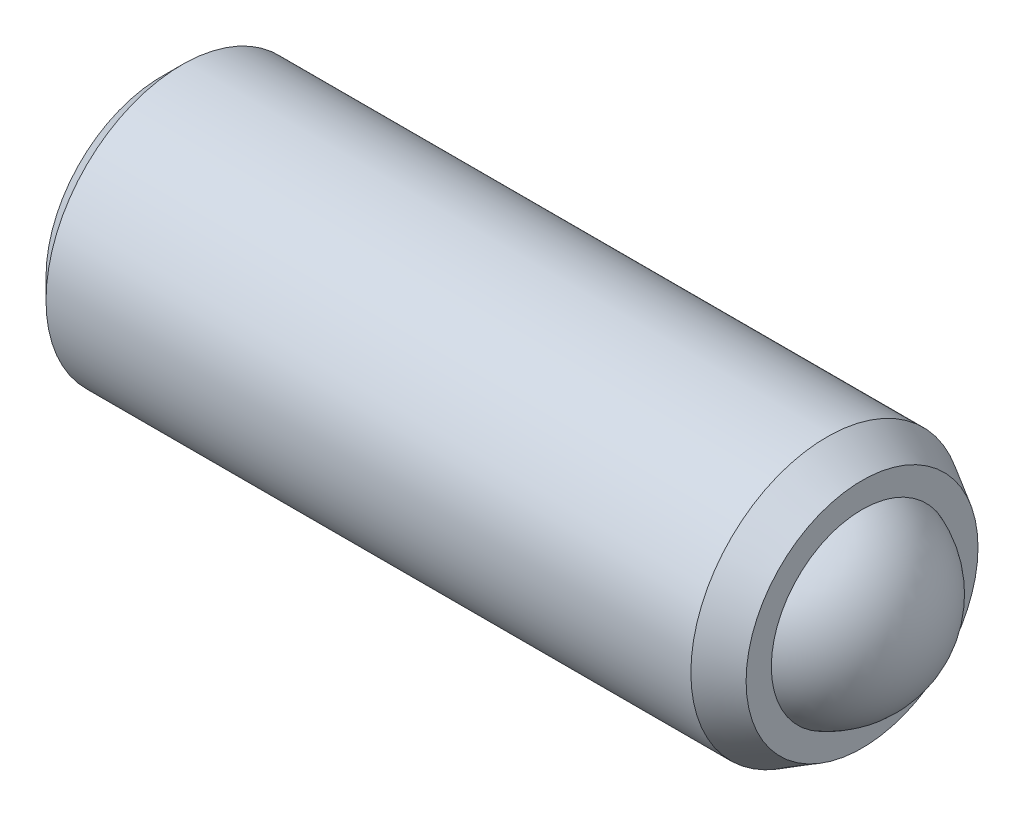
ISO-10303-21;
HEADER;
FILE_DESCRIPTION(('STEP AP214'),'2;1');
FILE_NAME('part.step','',(''),(''),'','','');
FILE_SCHEMA(('AUTOMOTIVE_DESIGN { 1 0 10303 214 1 1 1 1 }'));
ENDSEC;
DATA;
#1=APPLICATION_CONTEXT('core data for automotive mechanical design processes');
#2=APPLICATION_PROTOCOL_DEFINITION('international standard','automotive_design',2000,#1);
#3=PRODUCT_CONTEXT('',#1,'mechanical');
#4=PRODUCT('Part','Part','',(#3));
#5=PRODUCT_RELATED_PRODUCT_CATEGORY('part','',(#4));
#6=PRODUCT_DEFINITION_FORMATION('','',#4);
#7=PRODUCT_DEFINITION_CONTEXT('part definition',#1,'design');
#8=PRODUCT_DEFINITION('design','',#6,#7);
#9=PRODUCT_DEFINITION_SHAPE('','',#8);
#10=(LENGTH_UNIT() NAMED_UNIT(*) SI_UNIT(.MILLI.,.METRE.));
#11=(NAMED_UNIT(*) PLANE_ANGLE_UNIT() SI_UNIT($,.RADIAN.));
#12=(NAMED_UNIT(*) SI_UNIT($,.STERADIAN.) SOLID_ANGLE_UNIT());
#13=UNCERTAINTY_MEASURE_WITH_UNIT(LENGTH_MEASURE(1.E-05),#10,'distance_accuracy_value','');
#14=(GEOMETRIC_REPRESENTATION_CONTEXT(3) GLOBAL_UNCERTAINTY_ASSIGNED_CONTEXT((#13)) GLOBAL_UNIT_ASSIGNED_CONTEXT((#10,
#11,#12)) REPRESENTATION_CONTEXT('',''));
#15=CARTESIAN_POINT('',(0.,0.,0.));
#16=DIRECTION('',(0.,0.,1.));
#17=DIRECTION('',(1.,0.,0.));
#18=AXIS2_PLACEMENT_3D('',#15,#16,#17);
#19=CARTESIAN_POINT('',(8.55,0.,0.));
#20=DIRECTION('',(0.,-1.,0.));
#21=DIRECTION('',(-1.,0.,0.));
#22=AXIS2_PLACEMENT_3D('',#19,#20,#21);
#23=SPHERICAL_SURFACE('',#22,1.25);
#24=CARTESIAN_POINT('',(8.55,-1.25,0.));
#25=VERTEX_POINT('',#24);
#26=VERTEX_LOOP('',#25);
#27=FACE_BOUND('',#26,.T.);
#28=ADVANCED_FACE('P0_F11',(#27),#23,.T.);
#29=CLOSED_SHELL('',(#28));
#30=MANIFOLD_SOLID_BREP('P0_B1',#29);
#31=CARTESIAN_POINT('',(0.,0.,0.));
#32=DIRECTION('',(1.,0.,0.));
#33=DIRECTION('',(0.,0.,-1.));
#34=AXIS2_PLACEMENT_3D('',#31,#32,#33);
#35=PLANE('',#34);
#36=CARTESIAN_POINT('',(0.,0.,0.));
#37=DIRECTION('',(-1.,0.,0.));
#38=DIRECTION('',(0.,0.,1.));
#39=AXIS2_PLACEMENT_3D('',#36,#37,#38);
#40=CIRCLE('',#39,1.4875);
#41=CARTESIAN_POINT('',(0.,0.,1.4875));
#42=VERTEX_POINT('',#41);
#43=EDGE_CURVE('P1_E10',#42,#42,#40,.T.);
#44=ORIENTED_EDGE('',*,*,#43,.T.);
#45=EDGE_LOOP('',(#44));
#46=FACE_BOUND('',#45,.T.);
#47=ADVANCED_FACE('P1_F15',(#46),#35,.F.);
#48=CARTESIAN_POINT('',(0.2625,0.,0.));
#49=DIRECTION('',(1.,0.,0.));
#50=DIRECTION('',(0.,0.,-1.));
#51=AXIS2_PLACEMENT_3D('',#48,#49,#50);
#52=CONICAL_SURFACE('',#51,1.75,0.78539816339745);
#53=ORIENTED_EDGE('',*,*,#43,.F.);
#54=EDGE_LOOP('',(#53));
#55=FACE_BOUND('',#54,.T.);
#56=CARTESIAN_POINT('',(0.2625,0.,0.));
#57=DIRECTION('',(-1.,0.,0.));
#58=DIRECTION('',(0.,0.,1.));
#59=AXIS2_PLACEMENT_3D('',#56,#57,#58);
#60=CIRCLE('',#59,1.75);
#61=CARTESIAN_POINT('',(0.2625,0.,1.75));
#62=VERTEX_POINT('',#61);
#63=EDGE_CURVE('P1_E21',#62,#62,#60,.T.);
#64=ORIENTED_EDGE('',*,*,#63,.T.);
#65=EDGE_LOOP('',(#64));
#66=FACE_BOUND('',#65,.T.);
#67=ADVANCED_FACE('P1_F39',(#55,#66),#52,.T.);
#68=CARTESIAN_POINT('',(0.,0.,0.));
#69=DIRECTION('',(-1.,0.,0.));
#70=DIRECTION('',(0.,0.,1.));
#71=AXIS2_PLACEMENT_3D('',#68,#69,#70);
#72=CYLINDRICAL_SURFACE('',#71,1.75);
#73=ORIENTED_EDGE('',*,*,#63,.F.);
#74=EDGE_LOOP('',(#73));
#75=FACE_BOUND('',#74,.T.);
#76=CARTESIAN_POINT('',(8.55,0.,0.));
#77=DIRECTION('',(-1.,0.,0.));
#78=DIRECTION('',(0.,0.,1.));
#79=AXIS2_PLACEMENT_3D('',#76,#77,#78);
#80=CIRCLE('',#79,1.75);
#81=CARTESIAN_POINT('',(8.55,0.,1.75));
#82=VERTEX_POINT('',#81);
#83=EDGE_CURVE('P1_E52',#82,#82,#80,.T.);
#84=ORIENTED_EDGE('',*,*,#83,.T.);
#85=EDGE_LOOP('',(#84));
#86=FACE_BOUND('',#85,.T.);
#87=ADVANCED_FACE('P1_F45',(#75,#86),#72,.T.);
#88=CARTESIAN_POINT('',(9.,0.,0.));
#89=DIRECTION('',(-1.,0.,0.));
#90=DIRECTION('',(0.,0.,1.));
#91=AXIS2_PLACEMENT_3D('',#88,#89,#90);
#92=CONICAL_SURFACE('',#91,1.49019237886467,0.523598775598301);
#93=ORIENTED_EDGE('',*,*,#83,.F.);
#94=EDGE_LOOP('',(#93));
#95=FACE_BOUND('',#94,.T.);
#96=CARTESIAN_POINT('',(9.,0.,0.));
#97=DIRECTION('',(-1.,0.,0.));
#98=DIRECTION('',(0.,0.,1.));
#99=AXIS2_PLACEMENT_3D('',#96,#97,#98);
#100=CIRCLE('',#99,1.49019237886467);
#101=CARTESIAN_POINT('',(9.,0.,1.49019237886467));
#102=VERTEX_POINT('',#101);
#103=EDGE_CURVE('P1_E54',#102,#102,#100,.T.);
#104=ORIENTED_EDGE('',*,*,#103,.T.);
#105=EDGE_LOOP('',(#104));
#106=FACE_BOUND('',#105,.T.);
#107=ADVANCED_FACE('P1_F78',(#95,#106),#92,.T.);
#108=CARTESIAN_POINT('',(9.,1.49019237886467,0.));
#109=DIRECTION('',(-1.,0.,0.));
#110=DIRECTION('',(0.,0.,1.));
#111=AXIS2_PLACEMENT_3D('',#108,#109,#110);
#112=PLANE('',#111);
#113=ORIENTED_EDGE('',*,*,#103,.F.);
#114=EDGE_LOOP('',(#113));
#115=FACE_BOUND('',#114,.T.);
#116=CARTESIAN_POINT('',(9.,0.,0.));
#117=DIRECTION('',(-1.,0.,0.));
#118=DIRECTION('',(0.,0.,1.));
#119=AXIS2_PLACEMENT_3D('',#116,#117,#118);
#120=CIRCLE('',#119,1.16619037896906);
#121=CARTESIAN_POINT('',(9.,0.,1.16619037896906));
#122=VERTEX_POINT('',#121);
#123=EDGE_CURVE('P1_E59',#122,#122,#120,.T.);
#124=ORIENTED_EDGE('',*,*,#123,.T.);
#125=EDGE_LOOP('',(#124));
#126=FACE_BOUND('',#125,.T.);
#127=ADVANCED_FACE('P1_F71',(#115,#126),#112,.F.);
#128=CARTESIAN_POINT('',(8.55,0.,0.));
#129=DIRECTION('',(-1.,0.,0.));
#130=DIRECTION('',(0.,1.,0.));
#131=AXIS2_PLACEMENT_3D('',#128,#129,#130);
#132=SPHERICAL_SURFACE('',#131,1.25);
#133=ORIENTED_EDGE('',*,*,#123,.F.);
#134=EDGE_LOOP('',(#133));
#135=FACE_BOUND('',#134,.T.);
#136=CARTESIAN_POINT('',(8.55,0.,0.));
#137=DIRECTION('',(-1.,0.,0.));
#138=DIRECTION('',(0.,0.,1.));
#139=AXIS2_PLACEMENT_3D('',#136,#137,#138);
#140=CIRCLE('',#139,1.25);
#141=CARTESIAN_POINT('',(8.55,0.,1.25));
#142=VERTEX_POINT('',#141);
#143=EDGE_CURVE('P1_E62',#142,#142,#140,.T.);
#144=ORIENTED_EDGE('',*,*,#143,.T.);
#145=EDGE_LOOP('',(#144));
#146=FACE_BOUND('',#145,.T.);
#147=ADVANCED_FACE('P1_F34',(#135,#146),#132,.F.);
#148=CARTESIAN_POINT('',(0.,0.,0.));
#149=DIRECTION('',(-1.,0.,0.));
#150=DIRECTION('',(0.,0.,1.));
#151=AXIS2_PLACEMENT_3D('',#148,#149,#150);
#152=CYLINDRICAL_SURFACE('',#151,1.25);
#153=ORIENTED_EDGE('',*,*,#143,.F.);
#154=EDGE_LOOP('',(#153));
#155=FACE_BOUND('',#154,.T.);
#156=CARTESIAN_POINT('',(1.84668783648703,0.,0.));
#157=DIRECTION('',(-1.,0.,0.));
#158=DIRECTION('',(0.,0.,1.));
#159=AXIS2_PLACEMENT_3D('',#156,#157,#158);
#160=CIRCLE('',#159,1.25);
#161=CARTESIAN_POINT('',(1.84668783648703,0.,1.25));
#162=VERTEX_POINT('',#161);
#163=EDGE_CURVE('P1_E65',#162,#162,#160,.T.);
#164=ORIENTED_EDGE('',*,*,#163,.T.);
#165=EDGE_LOOP('',(#164));
#166=FACE_BOUND('',#165,.T.);
#167=ADVANCED_FACE('P1_F26',(#155,#166),#152,.F.);
#168=CARTESIAN_POINT('',(1.125,0.,0.));
#169=DIRECTION('',(1.,0.,0.));
#170=DIRECTION('',(0.,0.,-1.));
#171=AXIS2_PLACEMENT_3D('',#168,#169,#170);
#172=CONICAL_SURFACE('',#171,0.,1.0471975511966);
#173=ORIENTED_EDGE('',*,*,#163,.F.);
#174=EDGE_LOOP('',(#173));
#175=FACE_BOUND('',#174,.T.);
#176=CARTESIAN_POINT('',(1.125,0.,0.));
#177=VERTEX_POINT('',#176);
#178=VERTEX_LOOP('',#177);
#179=FACE_BOUND('',#178,.T.);
#180=ADVANCED_FACE('P1_F24',(#175,#179),#172,.F.);
#181=CLOSED_SHELL('',(#47,#67,#87,#107,#127,#147,#167,#180));
#182=MANIFOLD_SOLID_BREP('P1_B1',#181);
#183=ADVANCED_BREP_SHAPE_REPRESENTATION('',(#18,#30,#182),#14);
#184=SHAPE_DEFINITION_REPRESENTATION(#9,#183);
ENDSEC;
END-ISO-10303-21;
